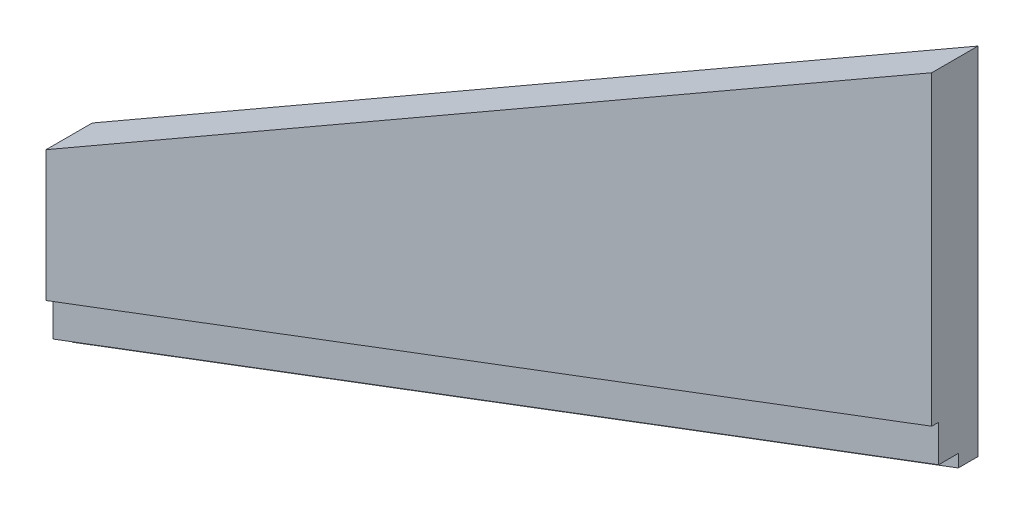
ISO-10303-21;
HEADER;
FILE_DESCRIPTION(('STEP AP214'),'2;1');
FILE_NAME('part.step','',(''),(''),'','','');
FILE_SCHEMA(('AUTOMOTIVE_DESIGN { 1 0 10303 214 1 1 1 1 }'));
ENDSEC;
DATA;
#1=APPLICATION_CONTEXT('core data for automotive mechanical design processes');
#2=APPLICATION_PROTOCOL_DEFINITION('international standard','automotive_design',2000,#1);
#3=PRODUCT_CONTEXT('',#1,'mechanical');
#4=PRODUCT('Part','Part','',(#3));
#5=PRODUCT_RELATED_PRODUCT_CATEGORY('part','',(#4));
#6=PRODUCT_DEFINITION_FORMATION('','',#4);
#7=PRODUCT_DEFINITION_CONTEXT('part definition',#1,'design');
#8=PRODUCT_DEFINITION('design','',#6,#7);
#9=PRODUCT_DEFINITION_SHAPE('','',#8);
#10=(LENGTH_UNIT() NAMED_UNIT(*) SI_UNIT(.MILLI.,.METRE.));
#11=(NAMED_UNIT(*) PLANE_ANGLE_UNIT() SI_UNIT($,.RADIAN.));
#12=(NAMED_UNIT(*) SI_UNIT($,.STERADIAN.) SOLID_ANGLE_UNIT());
#13=UNCERTAINTY_MEASURE_WITH_UNIT(LENGTH_MEASURE(1.E-05),#10,'distance_accuracy_value','');
#14=(GEOMETRIC_REPRESENTATION_CONTEXT(3) GLOBAL_UNCERTAINTY_ASSIGNED_CONTEXT((#13)) GLOBAL_UNIT_ASSIGNED_CONTEXT((#10,
#11,#12)) REPRESENTATION_CONTEXT('',''));
#15=CARTESIAN_POINT('',(0.,0.,0.));
#16=DIRECTION('',(0.,0.,1.));
#17=DIRECTION('',(1.,0.,0.));
#18=AXIS2_PLACEMENT_3D('',#15,#16,#17);
#19=CARTESIAN_POINT('',(1.14114555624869E-13,-931.846836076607,47.));
#20=DIRECTION('',(-0.352820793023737,0.935690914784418,0.));
#21=DIRECTION('',(-0.935690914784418,-0.352820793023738,0.));
#22=AXIS2_PLACEMENT_3D('',#19,#20,#21);
#23=PLANE('',#22);
#24=DIRECTION('',(0.,0.,-1.));
#25=VECTOR('',#24,1.);
#26=CARTESIAN_POINT('',(-900.,-1271.20966273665,47.));
#27=LINE('',#26,#25);
#28=CARTESIAN_POINT('',(-900.,-1271.20966273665,47.));
#29=VERTEX_POINT('',#28);
#30=CARTESIAN_POINT('',(-900.,-1271.20966273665,40.));
#31=VERTEX_POINT('',#30);
#32=EDGE_CURVE('E49',#29,#31,#27,.T.);
#33=ORIENTED_EDGE('',*,*,#32,.T.);
#34=DIRECTION('',(0.935690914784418,0.352820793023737,0.));
#35=VECTOR('',#34,1.);
#36=CARTESIAN_POINT('',(1.14114555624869E-13,-931.846836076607,40.));
#37=LINE('',#36,#35);
#38=CARTESIAN_POINT('',(1.14114555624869E-13,-931.846836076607,40.));
#39=VERTEX_POINT('',#38);
#40=EDGE_CURVE('E45',#31,#39,#37,.T.);
#41=ORIENTED_EDGE('',*,*,#40,.T.);
#42=DIRECTION('',(0.,0.,-1.));
#43=VECTOR('',#42,1.);
#44=CARTESIAN_POINT('',(1.14114555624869E-13,-931.846836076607,47.));
#45=LINE('',#44,#43);
#46=CARTESIAN_POINT('',(1.14114555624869E-13,-931.846836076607,47.));
#47=VERTEX_POINT('',#46);
#48=EDGE_CURVE('E11',#47,#39,#45,.T.);
#49=ORIENTED_EDGE('',*,*,#48,.F.);
#50=DIRECTION('',(0.935690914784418,0.352820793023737,0.));
#51=VECTOR('',#50,1.);
#52=CARTESIAN_POINT('',(1.14114555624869E-13,-931.846836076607,47.));
#53=LINE('',#52,#51);
#54=EDGE_CURVE('E147',#29,#47,#53,.T.);
#55=ORIENTED_EDGE('',*,*,#54,.F.);
#56=EDGE_LOOP('',(#33,#41,#49,#55));
#57=FACE_BOUND('',#56,.T.);
#58=ADVANCED_FACE('F31',(#57),#23,.F.);
#59=CARTESIAN_POINT('',(0.,-620.78030507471,47.));
#60=DIRECTION('',(-1.,0.,0.));
#61=DIRECTION('',(0.,-1.,0.));
#62=AXIS2_PLACEMENT_3D('',#59,#60,#61);
#63=PLANE('',#62);
#64=DIRECTION('',(0.,1.,0.));
#65=VECTOR('',#64,1.);
#66=CARTESIAN_POINT('',(0.,-620.78030507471,0.));
#67=LINE('',#66,#65);
#68=CARTESIAN_POINT('',(0.,-982.077098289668,0.));
#69=VERTEX_POINT('',#68);
#70=CARTESIAN_POINT('',(0.,-620.78030507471,0.));
#71=VERTEX_POINT('',#70);
#72=EDGE_CURVE('E94',#69,#71,#67,.T.);
#73=ORIENTED_EDGE('',*,*,#72,.T.);
#74=DIRECTION('',(0.,0.,-1.));
#75=VECTOR('',#74,1.);
#76=CARTESIAN_POINT('',(0.,-620.78030507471,47.));
#77=LINE('',#76,#75);
#78=CARTESIAN_POINT('',(0.,-620.78030507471,47.));
#79=VERTEX_POINT('',#78);
#80=EDGE_CURVE('E38',#79,#71,#77,.T.);
#81=ORIENTED_EDGE('',*,*,#80,.F.);
#82=DIRECTION('',(0.,1.,0.));
#83=VECTOR('',#82,1.);
#84=CARTESIAN_POINT('',(0.,-620.78030507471,47.));
#85=LINE('',#84,#83);
#86=EDGE_CURVE('E150',#47,#79,#85,.T.);
#87=ORIENTED_EDGE('',*,*,#86,.F.);
#88=ORIENTED_EDGE('',*,*,#48,.T.);
#89=DIRECTION('',(0.,-1.,0.));
#90=VECTOR('',#89,1.);
#91=CARTESIAN_POINT('',(1.14114555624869E-13,-931.846836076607,40.));
#92=LINE('',#91,#90);
#93=CARTESIAN_POINT('',(0.,-969.252350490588,40.));
#94=VERTEX_POINT('',#93);
#95=EDGE_CURVE('E131',#39,#94,#92,.T.);
#96=ORIENTED_EDGE('',*,*,#95,.T.);
#97=DIRECTION('',(0.,0.,-1.));
#98=VECTOR('',#97,1.);
#99=CARTESIAN_POINT('',(0.,-969.252350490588,40.));
#100=LINE('',#99,#98);
#101=CARTESIAN_POINT('',(0.,-969.252350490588,20.));
#102=VERTEX_POINT('',#101);
#103=EDGE_CURVE('E140',#94,#102,#100,.T.);
#104=ORIENTED_EDGE('',*,*,#103,.T.);
#105=DIRECTION('',(0.,-1.,0.));
#106=VECTOR('',#105,1.);
#107=CARTESIAN_POINT('',(0.,-969.252350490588,20.));
#108=LINE('',#107,#106);
#109=CARTESIAN_POINT('',(0.,-982.077098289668,20.));
#110=VERTEX_POINT('',#109);
#111=EDGE_CURVE('E110',#102,#110,#108,.T.);
#112=ORIENTED_EDGE('',*,*,#111,.T.);
#113=DIRECTION('',(0.,0.,-1.));
#114=VECTOR('',#113,1.);
#115=CARTESIAN_POINT('',(0.,-982.077098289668,20.));
#116=LINE('',#115,#114);
#117=EDGE_CURVE('E107',#110,#69,#116,.T.);
#118=ORIENTED_EDGE('',*,*,#117,.T.);
#119=EDGE_LOOP('',(#73,#81,#87,#88,#96,#104,#112,#118));
#120=FACE_BOUND('',#119,.T.);
#121=ADVANCED_FACE('F108',(#120),#63,.F.);
#122=CARTESIAN_POINT('',(0.,-620.78030507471,47.));
#123=DIRECTION('',(0.498620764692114,-0.866820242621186,0.));
#124=DIRECTION('',(0.866820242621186,0.498620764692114,0.));
#125=AXIS2_PLACEMENT_3D('',#122,#123,#124);
#126=PLANE('',#125);
#127=DIRECTION('',(-0.866820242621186,-0.498620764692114,0.));
#128=VECTOR('',#127,1.);
#129=CARTESIAN_POINT('',(0.,-620.78030507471,0.));
#130=LINE('',#129,#128);
#131=CARTESIAN_POINT('',(-900.,-1138.48705228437,0.));
#132=VERTEX_POINT('',#131);
#133=EDGE_CURVE('E100',#71,#132,#130,.T.);
#134=ORIENTED_EDGE('',*,*,#133,.T.);
#135=DIRECTION('',(0.,0.,-1.));
#136=VECTOR('',#135,1.);
#137=CARTESIAN_POINT('',(-900.,-1138.48705228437,47.));
#138=LINE('',#137,#136);
#139=CARTESIAN_POINT('',(-900.,-1138.48705228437,47.));
#140=VERTEX_POINT('',#139);
#141=EDGE_CURVE('E157',#140,#132,#138,.T.);
#142=ORIENTED_EDGE('',*,*,#141,.F.);
#143=DIRECTION('',(-0.866820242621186,-0.498620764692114,0.));
#144=VECTOR('',#143,1.);
#145=CARTESIAN_POINT('',(0.,-620.78030507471,47.));
#146=LINE('',#145,#144);
#147=EDGE_CURVE('E152',#79,#140,#146,.T.);
#148=ORIENTED_EDGE('',*,*,#147,.F.);
#149=ORIENTED_EDGE('',*,*,#80,.T.);
#150=EDGE_LOOP('',(#134,#142,#148,#149));
#151=FACE_BOUND('',#150,.T.);
#152=ADVANCED_FACE('F161',(#151),#126,.F.);
#153=CARTESIAN_POINT('',(-900.,-1138.48705228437,47.));
#154=DIRECTION('',(1.,0.,0.));
#155=DIRECTION('',(0.,1.,0.));
#156=AXIS2_PLACEMENT_3D('',#153,#154,#155);
#157=PLANE('',#156);
#158=DIRECTION('',(0.,-1.,0.));
#159=VECTOR('',#158,1.);
#160=CARTESIAN_POINT('',(-900.,-1138.48705228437,0.));
#161=LINE('',#160,#159);
#162=CARTESIAN_POINT('',(-900.,-1321.43992494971,0.));
#163=VERTEX_POINT('',#162);
#164=EDGE_CURVE('E145',#132,#163,#161,.T.);
#165=ORIENTED_EDGE('',*,*,#164,.T.);
#166=DIRECTION('',(0.,0.,-1.));
#167=VECTOR('',#166,1.);
#168=CARTESIAN_POINT('',(-900.,-1321.43992494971,20.));
#169=LINE('',#168,#167);
#170=CARTESIAN_POINT('',(-900.,-1321.43992494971,20.));
#171=VERTEX_POINT('',#170);
#172=EDGE_CURVE('E114',#171,#163,#169,.T.);
#173=ORIENTED_EDGE('',*,*,#172,.F.);
#174=DIRECTION('',(0.,1.,0.));
#175=VECTOR('',#174,1.);
#176=CARTESIAN_POINT('',(-900.,-1308.61517715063,20.));
#177=LINE('',#176,#175);
#178=CARTESIAN_POINT('',(-900.,-1308.61517715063,20.));
#179=VERTEX_POINT('',#178);
#180=EDGE_CURVE('E115',#171,#179,#177,.T.);
#181=ORIENTED_EDGE('',*,*,#180,.T.);
#182=DIRECTION('',(0.,0.,-1.));
#183=VECTOR('',#182,1.);
#184=CARTESIAN_POINT('',(-900.,-1308.61517715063,40.));
#185=LINE('',#184,#183);
#186=CARTESIAN_POINT('',(-900.,-1308.61517715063,40.));
#187=VERTEX_POINT('',#186);
#188=EDGE_CURVE('E104',#187,#179,#185,.T.);
#189=ORIENTED_EDGE('',*,*,#188,.F.);
#190=DIRECTION('',(0.,1.,0.));
#191=VECTOR('',#190,1.);
#192=CARTESIAN_POINT('',(-900.,-1271.20966273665,40.));
#193=LINE('',#192,#191);
#194=EDGE_CURVE('E137',#187,#31,#193,.T.);
#195=ORIENTED_EDGE('',*,*,#194,.T.);
#196=ORIENTED_EDGE('',*,*,#32,.F.);
#197=DIRECTION('',(0.,-1.,0.));
#198=VECTOR('',#197,1.);
#199=CARTESIAN_POINT('',(-900.,-1138.48705228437,47.));
#200=LINE('',#199,#198);
#201=EDGE_CURVE('E154',#140,#29,#200,.T.);
#202=ORIENTED_EDGE('',*,*,#201,.F.);
#203=ORIENTED_EDGE('',*,*,#141,.T.);
#204=EDGE_LOOP('',(#165,#173,#181,#189,#195,#196,#202,#203));
#205=FACE_BOUND('',#204,.T.);
#206=ADVANCED_FACE('F174',(#205),#157,.F.);
#207=CARTESIAN_POINT('',(-900.,-1271.20966273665,47.));
#208=DIRECTION('',(0.,0.,1.));
#209=DIRECTION('',(1.,0.,0.));
#210=AXIS2_PLACEMENT_3D('',#207,#208,#209);
#211=PLANE('',#210);
#212=ORIENTED_EDGE('',*,*,#54,.T.);
#213=ORIENTED_EDGE('',*,*,#86,.T.);
#214=ORIENTED_EDGE('',*,*,#147,.T.);
#215=ORIENTED_EDGE('',*,*,#201,.T.);
#216=EDGE_LOOP('',(#212,#213,#214,#215));
#217=FACE_BOUND('',#216,.T.);
#218=ADVANCED_FACE('F165',(#217),#211,.T.);
#219=CARTESIAN_POINT('',(-900.,-1271.20966273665,0.));
#220=DIRECTION('',(0.,0.,1.));
#221=DIRECTION('',(1.,0.,0.));
#222=AXIS2_PLACEMENT_3D('',#219,#220,#221);
#223=PLANE('',#222);
#224=ORIENTED_EDGE('',*,*,#72,.F.);
#225=DIRECTION('',(-0.935690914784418,-0.352820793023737,0.));
#226=VECTOR('',#225,1.);
#227=CARTESIAN_POINT('',(-900.,-1321.43992494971,0.));
#228=LINE('',#227,#226);
#229=EDGE_CURVE('E99',#69,#163,#228,.T.);
#230=ORIENTED_EDGE('',*,*,#229,.T.);
#231=ORIENTED_EDGE('',*,*,#164,.F.);
#232=ORIENTED_EDGE('',*,*,#133,.F.);
#233=EDGE_LOOP('',(#224,#230,#231,#232));
#234=FACE_BOUND('',#233,.T.);
#235=ADVANCED_FACE('F96',(#234),#223,.F.);
#236=CARTESIAN_POINT('',(-900.,-1308.61517715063,40.));
#237=DIRECTION('',(0.352820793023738,-0.935690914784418,0.));
#238=DIRECTION('',(0.935690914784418,0.352820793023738,0.));
#239=AXIS2_PLACEMENT_3D('',#236,#237,#238);
#240=PLANE('',#239);
#241=DIRECTION('',(0.935690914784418,0.352820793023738,0.));
#242=VECTOR('',#241,1.);
#243=CARTESIAN_POINT('',(0.,-969.252350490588,20.));
#244=LINE('',#243,#242);
#245=EDGE_CURVE('E119',#179,#102,#244,.T.);
#246=ORIENTED_EDGE('',*,*,#245,.T.);
#247=ORIENTED_EDGE('',*,*,#103,.F.);
#248=DIRECTION('',(-0.935690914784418,-0.352820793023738,0.));
#249=VECTOR('',#248,1.);
#250=CARTESIAN_POINT('',(-900.,-1308.61517715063,40.));
#251=LINE('',#250,#249);
#252=EDGE_CURVE('E134',#94,#187,#251,.T.);
#253=ORIENTED_EDGE('',*,*,#252,.T.);
#254=ORIENTED_EDGE('',*,*,#188,.T.);
#255=EDGE_LOOP('',(#246,#247,#253,#254));
#256=FACE_BOUND('',#255,.T.);
#257=ADVANCED_FACE('F184',(#256),#240,.T.);
#258=CARTESIAN_POINT('',(-900.,-1271.20966273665,40.));
#259=DIRECTION('',(0.,0.,1.));
#260=DIRECTION('',(1.,0.,0.));
#261=AXIS2_PLACEMENT_3D('',#258,#259,#260);
#262=PLANE('',#261);
#263=ORIENTED_EDGE('',*,*,#40,.F.);
#264=ORIENTED_EDGE('',*,*,#194,.F.);
#265=ORIENTED_EDGE('',*,*,#252,.F.);
#266=ORIENTED_EDGE('',*,*,#95,.F.);
#267=EDGE_LOOP('',(#263,#264,#265,#266));
#268=FACE_BOUND('',#267,.T.);
#269=ADVANCED_FACE('F187',(#268),#262,.T.);
#270=CARTESIAN_POINT('',(-900.,-1321.43992494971,20.));
#271=DIRECTION('',(0.352820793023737,-0.935690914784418,0.));
#272=DIRECTION('',(0.935690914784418,0.352820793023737,0.));
#273=AXIS2_PLACEMENT_3D('',#270,#271,#272);
#274=PLANE('',#273);
#275=ORIENTED_EDGE('',*,*,#229,.F.);
#276=ORIENTED_EDGE('',*,*,#117,.F.);
#277=DIRECTION('',(-0.935690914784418,-0.352820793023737,0.));
#278=VECTOR('',#277,1.);
#279=CARTESIAN_POINT('',(-900.,-1321.43992494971,20.));
#280=LINE('',#279,#278);
#281=EDGE_CURVE('E125',#110,#171,#280,.T.);
#282=ORIENTED_EDGE('',*,*,#281,.T.);
#283=ORIENTED_EDGE('',*,*,#172,.T.);
#284=EDGE_LOOP('',(#275,#276,#282,#283));
#285=FACE_BOUND('',#284,.T.);
#286=ADVANCED_FACE('F118',(#285),#274,.T.);
#287=CARTESIAN_POINT('',(-900.,-1308.61517715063,20.));
#288=DIRECTION('',(0.,0.,1.));
#289=DIRECTION('',(1.,0.,0.));
#290=AXIS2_PLACEMENT_3D('',#287,#288,#289);
#291=PLANE('',#290);
#292=ORIENTED_EDGE('',*,*,#245,.F.);
#293=ORIENTED_EDGE('',*,*,#180,.F.);
#294=ORIENTED_EDGE('',*,*,#281,.F.);
#295=ORIENTED_EDGE('',*,*,#111,.F.);
#296=EDGE_LOOP('',(#292,#293,#294,#295));
#297=FACE_BOUND('',#296,.T.);
#298=ADVANCED_FACE('F194',(#297),#291,.T.);
#299=CLOSED_SHELL('',(#58,#121,#152,#206,#218,#235,#257,#269,#286,#298));
#300=MANIFOLD_SOLID_BREP('B2',#299);
#301=ADVANCED_BREP_SHAPE_REPRESENTATION('',(#18,#300),#14);
#302=SHAPE_DEFINITION_REPRESENTATION(#9,#301);
ENDSEC;
END-ISO-10303-21;
